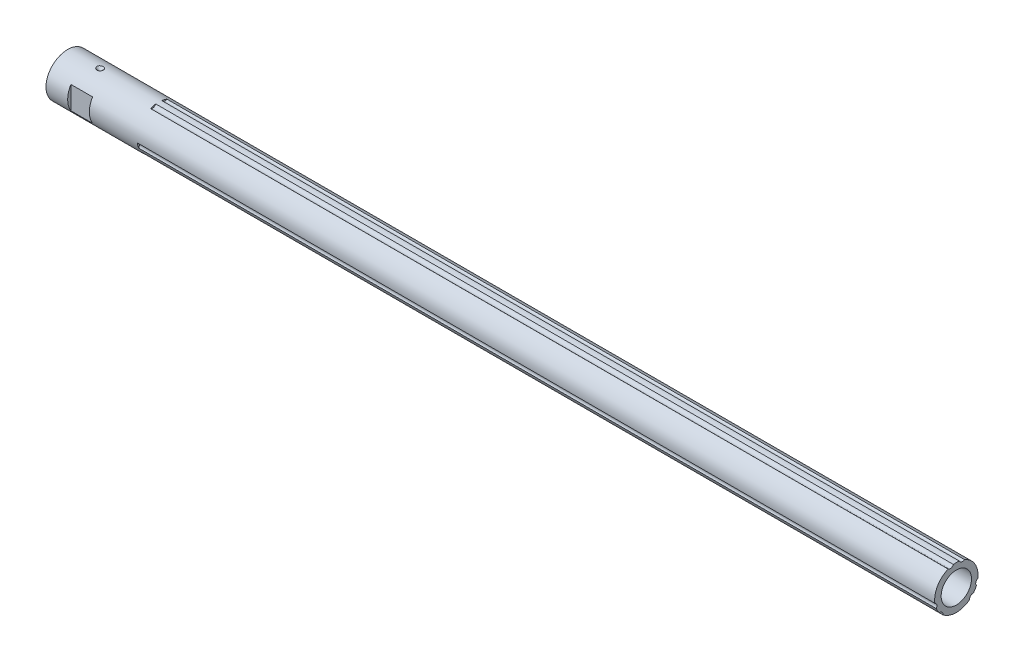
ISO-10303-21;
HEADER;
FILE_DESCRIPTION(('STEP AP214'),'2;1');
FILE_NAME('part.step','',(''),(''),'','','');
FILE_SCHEMA(('AUTOMOTIVE_DESIGN { 1 0 10303 214 1 1 1 1 }'));
ENDSEC;
DATA;
#1=APPLICATION_CONTEXT('core data for automotive mechanical design processes');
#2=APPLICATION_PROTOCOL_DEFINITION('international standard','automotive_design',2000,#1);
#3=PRODUCT_CONTEXT('',#1,'mechanical');
#4=PRODUCT('Part','Part','',(#3));
#5=PRODUCT_RELATED_PRODUCT_CATEGORY('part','',(#4));
#6=PRODUCT_DEFINITION_FORMATION('','',#4);
#7=PRODUCT_DEFINITION_CONTEXT('part definition',#1,'design');
#8=PRODUCT_DEFINITION('design','',#6,#7);
#9=PRODUCT_DEFINITION_SHAPE('','',#8);
#10=(LENGTH_UNIT() NAMED_UNIT(*) SI_UNIT(.MILLI.,.METRE.));
#11=(NAMED_UNIT(*) PLANE_ANGLE_UNIT() SI_UNIT($,.RADIAN.));
#12=(NAMED_UNIT(*) SI_UNIT($,.STERADIAN.) SOLID_ANGLE_UNIT());
#13=UNCERTAINTY_MEASURE_WITH_UNIT(LENGTH_MEASURE(1.E-05),#10,'distance_accuracy_value','');
#14=(GEOMETRIC_REPRESENTATION_CONTEXT(3) GLOBAL_UNCERTAINTY_ASSIGNED_CONTEXT((#13)) GLOBAL_UNIT_ASSIGNED_CONTEXT((#10,
#11,#12)) REPRESENTATION_CONTEXT('',''));
#15=CARTESIAN_POINT('',(0.,0.,0.));
#16=DIRECTION('',(0.,0.,1.));
#17=DIRECTION('',(1.,0.,0.));
#18=AXIS2_PLACEMENT_3D('',#15,#16,#17);
#19=CARTESIAN_POINT('',(0.,0.,0.));
#20=DIRECTION('',(1.,0.,0.));
#21=DIRECTION('',(0.,0.,-1.));
#22=AXIS2_PLACEMENT_3D('',#19,#20,#21);
#23=PLANE('',#22);
#24=CARTESIAN_POINT('',(0.,-2.82112759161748,-10.5285915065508));
#25=DIRECTION('',(1.,0.,0.));
#26=DIRECTION('',(0.,0.,-1.));
#27=AXIS2_PLACEMENT_3D('',#24,#25,#26);
#28=CIRCLE('',#27,1.588);
#29=CARTESIAN_POINT('',(0.,-1.35978777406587,-9.9071175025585));
#30=VERTEX_POINT('',#29);
#31=CARTESIAN_POINT('',(0.,-3.77594799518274,-9.25970932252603));
#32=VERTEX_POINT('',#31);
#33=EDGE_CURVE('E352',#30,#32,#28,.T.);
#34=ORIENTED_EDGE('',*,*,#33,.T.);
#35=CARTESIAN_POINT('',(0.,0.,0.));
#36=DIRECTION('',(-1.,0.,0.));
#37=DIRECTION('',(0.,0.,1.));
#38=AXIS2_PLACEMENT_3D('',#35,#36,#37);
#39=CIRCLE('',#38,10.);
#40=EDGE_CURVE('E190',#30,#32,#39,.T.);
#41=ORIENTED_EDGE('',*,*,#40,.F.);
#42=EDGE_LOOP('',(#34,#41));
#43=FACE_BOUND('',#42,.T.);
#44=ADVANCED_FACE('F17',(#43),#23,.T.);
#45=CARTESIAN_POINT('',(0.,0.,0.));
#46=DIRECTION('',(1.,0.,0.));
#47=DIRECTION('',(0.,0.,-1.));
#48=AXIS2_PLACEMENT_3D('',#45,#46,#47);
#49=PLANE('',#48);
#50=CARTESIAN_POINT('',(0.,-7.70746391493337,-7.70746391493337));
#51=DIRECTION('',(1.,0.,0.));
#52=DIRECTION('',(0.,0.,-1.));
#53=AXIS2_PLACEMENT_3D('',#50,#51,#52);
#54=CIRCLE('',#53,1.588);
#55=CARTESIAN_POINT('',(0.,-6.1311695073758,-7.89992154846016));
#56=VERTEX_POINT('',#55);
#57=CARTESIAN_POINT('',(0.,-7.89992154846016,-6.13116950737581));
#58=VERTEX_POINT('',#57);
#59=EDGE_CURVE('E20',#56,#58,#54,.T.);
#60=ORIENTED_EDGE('',*,*,#59,.T.);
#61=CARTESIAN_POINT('',(0.,0.,0.));
#62=DIRECTION('',(-1.,0.,0.));
#63=DIRECTION('',(0.,0.,1.));
#64=AXIS2_PLACEMENT_3D('',#61,#62,#63);
#65=CIRCLE('',#64,10.);
#66=EDGE_CURVE('E171',#56,#58,#65,.T.);
#67=ORIENTED_EDGE('',*,*,#66,.F.);
#68=EDGE_LOOP('',(#60,#67));
#69=FACE_BOUND('',#68,.T.);
#70=ADVANCED_FACE('F445',(#69),#49,.T.);
#71=CARTESIAN_POINT('',(0.,0.,0.));
#72=DIRECTION('',(1.,0.,0.));
#73=DIRECTION('',(0.,0.,-1.));
#74=AXIS2_PLACEMENT_3D('',#71,#72,#73);
#75=PLANE('',#74);
#76=CARTESIAN_POINT('',(0.,0.,0.));
#77=DIRECTION('',(-1.,0.,0.));
#78=DIRECTION('',(0.,0.,1.));
#79=AXIS2_PLACEMENT_3D('',#76,#77,#78);
#80=CIRCLE('',#79,10.);
#81=CARTESIAN_POINT('',(0.,-7.89992154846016,6.1311695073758));
#82=VERTEX_POINT('',#81);
#83=CARTESIAN_POINT('',(0.,-6.13116950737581,7.89992154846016));
#84=VERTEX_POINT('',#83);
#85=EDGE_CURVE('E154',#82,#84,#80,.T.);
#86=ORIENTED_EDGE('',*,*,#85,.F.);
#87=CARTESIAN_POINT('',(0.,-7.70746391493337,7.70746391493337));
#88=DIRECTION('',(1.,0.,0.));
#89=DIRECTION('',(0.,0.,-1.));
#90=AXIS2_PLACEMENT_3D('',#87,#88,#89);
#91=CIRCLE('',#90,1.588);
#92=EDGE_CURVE('E140',#82,#84,#91,.T.);
#93=ORIENTED_EDGE('',*,*,#92,.T.);
#94=EDGE_LOOP('',(#86,#93));
#95=FACE_BOUND('',#94,.T.);
#96=ADVANCED_FACE('F155',(#95),#75,.T.);
#97=CARTESIAN_POINT('',(0.,0.,0.));
#98=DIRECTION('',(1.,0.,0.));
#99=DIRECTION('',(0.,0.,-1.));
#100=AXIS2_PLACEMENT_3D('',#97,#98,#99);
#101=PLANE('',#100);
#102=CARTESIAN_POINT('',(0.,0.,0.));
#103=DIRECTION('',(-1.,0.,0.));
#104=DIRECTION('',(0.,0.,1.));
#105=AXIS2_PLACEMENT_3D('',#102,#103,#104);
#106=CIRCLE('',#105,10.);
#107=CARTESIAN_POINT('',(0.,-3.77594799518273,9.25970932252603));
#108=VERTEX_POINT('',#107);
#109=CARTESIAN_POINT('',(0.,-1.35978777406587,9.9071175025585));
#110=VERTEX_POINT('',#109);
#111=EDGE_CURVE('E180',#108,#110,#106,.T.);
#112=ORIENTED_EDGE('',*,*,#111,.F.);
#113=CARTESIAN_POINT('',(0.,-2.82112759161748,10.5285915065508));
#114=DIRECTION('',(1.,0.,0.));
#115=DIRECTION('',(0.,0.,-1.));
#116=AXIS2_PLACEMENT_3D('',#113,#114,#115);
#117=CIRCLE('',#116,1.588);
#118=EDGE_CURVE('E152',#108,#110,#117,.T.);
#119=ORIENTED_EDGE('',*,*,#118,.T.);
#120=EDGE_LOOP('',(#112,#119));
#121=FACE_BOUND('',#120,.T.);
#122=ADVANCED_FACE('F434',(#121),#101,.T.);
#123=CARTESIAN_POINT('',(189.,-7.70746391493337,-7.70746391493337));
#124=DIRECTION('',(1.,0.,0.));
#125=DIRECTION('',(0.,0.,-1.));
#126=AXIS2_PLACEMENT_3D('',#123,#124,#125);
#127=CYLINDRICAL_SURFACE('',#126,1.588);
#128=CARTESIAN_POINT('',(368.,-7.70746391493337,-7.70746391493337));
#129=DIRECTION('',(1.,0.,0.));
#130=DIRECTION('',(0.,0.,-1.));
#131=AXIS2_PLACEMENT_3D('',#128,#129,#130);
#132=CIRCLE('',#131,1.588);
#133=CARTESIAN_POINT('',(368.,-7.89992154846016,-6.13116950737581));
#134=VERTEX_POINT('',#133);
#135=CARTESIAN_POINT('',(368.,-6.1311695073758,-7.89992154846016));
#136=VERTEX_POINT('',#135);
#137=EDGE_CURVE('E367',#134,#136,#132,.F.);
#138=ORIENTED_EDGE('',*,*,#137,.F.);
#139=DIRECTION('',(-1.,0.,0.));
#140=VECTOR('',#139,1.);
#141=CARTESIAN_POINT('',(189.,-7.89992154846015,-6.13116950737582));
#142=LINE('',#141,#140);
#143=EDGE_CURVE('E166',#58,#134,#142,.F.);
#144=ORIENTED_EDGE('',*,*,#143,.F.);
#145=ORIENTED_EDGE('',*,*,#59,.F.);
#146=DIRECTION('',(-1.,0.,0.));
#147=VECTOR('',#146,1.);
#148=CARTESIAN_POINT('',(189.,-6.1311695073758,-7.89992154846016));
#149=LINE('',#148,#147);
#150=EDGE_CURVE('E195',#136,#56,#149,.T.);
#151=ORIENTED_EDGE('',*,*,#150,.F.);
#152=EDGE_LOOP('',(#138,#144,#145,#151));
#153=FACE_BOUND('',#152,.T.);
#154=ADVANCED_FACE('F436',(#153),#127,.F.);
#155=CARTESIAN_POINT('',(189.,-2.82112759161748,-10.5285915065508));
#156=DIRECTION('',(1.,0.,0.));
#157=DIRECTION('',(0.,0.,-1.));
#158=AXIS2_PLACEMENT_3D('',#155,#156,#157);
#159=CYLINDRICAL_SURFACE('',#158,1.588);
#160=CARTESIAN_POINT('',(368.,-2.82112759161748,-10.5285915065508));
#161=DIRECTION('',(1.,0.,0.));
#162=DIRECTION('',(0.,0.,-1.));
#163=AXIS2_PLACEMENT_3D('',#160,#161,#162);
#164=CIRCLE('',#163,1.588);
#165=CARTESIAN_POINT('',(368.,-3.77594799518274,-9.25970932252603));
#166=VERTEX_POINT('',#165);
#167=CARTESIAN_POINT('',(368.,-1.35978777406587,-9.9071175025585));
#168=VERTEX_POINT('',#167);
#169=EDGE_CURVE('E372',#166,#168,#164,.F.);
#170=ORIENTED_EDGE('',*,*,#169,.F.);
#171=DIRECTION('',(-1.,0.,0.));
#172=VECTOR('',#171,1.);
#173=CARTESIAN_POINT('',(189.,-3.77594799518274,-9.25970932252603));
#174=LINE('',#173,#172);
#175=EDGE_CURVE('E192',#32,#166,#174,.F.);
#176=ORIENTED_EDGE('',*,*,#175,.F.);
#177=ORIENTED_EDGE('',*,*,#33,.F.);
#178=DIRECTION('',(-1.,0.,0.));
#179=VECTOR('',#178,1.);
#180=CARTESIAN_POINT('',(189.,-1.35978777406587,-9.9071175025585));
#181=LINE('',#180,#179);
#182=EDGE_CURVE('E186',#168,#30,#181,.T.);
#183=ORIENTED_EDGE('',*,*,#182,.F.);
#184=EDGE_LOOP('',(#170,#176,#177,#183));
#185=FACE_BOUND('',#184,.T.);
#186=ADVANCED_FACE('F442',(#185),#159,.F.);
#187=CARTESIAN_POINT('',(189.,-2.82112759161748,10.5285915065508));
#188=DIRECTION('',(1.,0.,0.));
#189=DIRECTION('',(0.,0.,-1.));
#190=AXIS2_PLACEMENT_3D('',#187,#188,#189);
#191=CYLINDRICAL_SURFACE('',#190,1.588);
#192=ORIENTED_EDGE('',*,*,#118,.F.);
#193=DIRECTION('',(-1.,0.,0.));
#194=VECTOR('',#193,1.);
#195=CARTESIAN_POINT('',(189.,-3.77594799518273,9.25970932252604));
#196=LINE('',#195,#194);
#197=CARTESIAN_POINT('',(368.,-3.77594799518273,9.25970932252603));
#198=VERTEX_POINT('',#197);
#199=EDGE_CURVE('E176',#198,#108,#196,.T.);
#200=ORIENTED_EDGE('',*,*,#199,.F.);
#201=CARTESIAN_POINT('',(368.,-2.82112759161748,10.5285915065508));
#202=DIRECTION('',(1.,0.,0.));
#203=DIRECTION('',(0.,0.,-1.));
#204=AXIS2_PLACEMENT_3D('',#201,#202,#203);
#205=CIRCLE('',#204,1.588);
#206=CARTESIAN_POINT('',(368.,-1.35978777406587,9.9071175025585));
#207=VERTEX_POINT('',#206);
#208=EDGE_CURVE('E391',#207,#198,#205,.F.);
#209=ORIENTED_EDGE('',*,*,#208,.F.);
#210=DIRECTION('',(-1.,0.,0.));
#211=VECTOR('',#210,1.);
#212=CARTESIAN_POINT('',(189.,-1.35978777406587,9.9071175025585));
#213=LINE('',#212,#211);
#214=EDGE_CURVE('E181',#110,#207,#213,.F.);
#215=ORIENTED_EDGE('',*,*,#214,.F.);
#216=EDGE_LOOP('',(#192,#200,#209,#215));
#217=FACE_BOUND('',#216,.T.);
#218=ADVANCED_FACE('F414',(#217),#191,.F.);
#219=CARTESIAN_POINT('',(189.,-7.70746391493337,7.70746391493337));
#220=DIRECTION('',(1.,0.,0.));
#221=DIRECTION('',(0.,0.,-1.));
#222=AXIS2_PLACEMENT_3D('',#219,#220,#221);
#223=CYLINDRICAL_SURFACE('',#222,1.588);
#224=ORIENTED_EDGE('',*,*,#92,.F.);
#225=DIRECTION('',(-1.,0.,0.));
#226=VECTOR('',#225,1.);
#227=CARTESIAN_POINT('',(189.,-7.89992154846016,6.1311695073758));
#228=LINE('',#227,#226);
#229=CARTESIAN_POINT('',(368.,-7.89992154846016,6.1311695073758));
#230=VERTEX_POINT('',#229);
#231=EDGE_CURVE('E145',#230,#82,#228,.T.);
#232=ORIENTED_EDGE('',*,*,#231,.F.);
#233=CARTESIAN_POINT('',(368.,-7.70746391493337,7.70746391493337));
#234=DIRECTION('',(1.,0.,0.));
#235=DIRECTION('',(0.,0.,-1.));
#236=AXIS2_PLACEMENT_3D('',#233,#234,#235);
#237=CIRCLE('',#236,1.588);
#238=CARTESIAN_POINT('',(368.,-6.13116950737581,7.89992154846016));
#239=VERTEX_POINT('',#238);
#240=EDGE_CURVE('E397',#239,#230,#237,.F.);
#241=ORIENTED_EDGE('',*,*,#240,.F.);
#242=DIRECTION('',(-1.,0.,0.));
#243=VECTOR('',#242,1.);
#244=CARTESIAN_POINT('',(189.,-6.13116950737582,7.89992154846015));
#245=LINE('',#244,#243);
#246=EDGE_CURVE('E147',#84,#239,#245,.F.);
#247=ORIENTED_EDGE('',*,*,#246,.F.);
#248=EDGE_LOOP('',(#224,#232,#241,#247));
#249=FACE_BOUND('',#248,.T.);
#250=ADVANCED_FACE('F142',(#249),#223,.F.);
#251=CARTESIAN_POINT('',(189.,0.,0.));
#252=DIRECTION('',(-1.,0.,0.));
#253=DIRECTION('',(0.,0.,1.));
#254=AXIS2_PLACEMENT_3D('',#251,#252,#253);
#255=CYLINDRICAL_SURFACE('',#254,7.);
#256=CARTESIAN_POINT('',(368.,0.,0.));
#257=DIRECTION('',(-1.,0.,0.));
#258=DIRECTION('',(0.,0.,1.));
#259=AXIS2_PLACEMENT_3D('',#256,#257,#258);
#260=CIRCLE('',#259,7.);
#261=CARTESIAN_POINT('',(368.,0.,7.));
#262=VERTEX_POINT('',#261);
#263=EDGE_CURVE('E359',#262,#262,#260,.T.);
#264=ORIENTED_EDGE('',*,*,#263,.F.);
#265=EDGE_LOOP('',(#264));
#266=FACE_BOUND('',#265,.T.);
#267=CARTESIAN_POINT('',(-42.,0.,0.));
#268=DIRECTION('',(-1.,0.,0.));
#269=DIRECTION('',(0.,0.,1.));
#270=AXIS2_PLACEMENT_3D('',#267,#268,#269);
#271=CIRCLE('',#270,7.);
#272=CARTESIAN_POINT('',(-42.,0.,7.));
#273=VERTEX_POINT('',#272);
#274=EDGE_CURVE('E330',#273,#273,#271,.T.);
#275=ORIENTED_EDGE('',*,*,#274,.T.);
#276=EDGE_LOOP('',(#275));
#277=FACE_BOUND('',#276,.T.);
#278=ADVANCED_FACE('F314',(#266,#277),#255,.F.);
#279=CARTESIAN_POINT('',(-27.,10.0089999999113,0.));
#280=DIRECTION('',(0.,1.,0.));
#281=DIRECTION('',(0.,0.,1.));
#282=AXIS2_PLACEMENT_3D('',#279,#280,#281);
#283=CONICAL_SURFACE('',#282,1.50899999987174,0.785398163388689);
#284=CARTESIAN_POINT('',(-26.9999999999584,8.5000000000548,0.));
#285=VERTEX_POINT('',#284);
#286=VERTEX_LOOP('',#285);
#287=FACE_BOUND('',#286,.T.);
#288=CARTESIAN_POINT('',(-25.5000000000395,10.,7.51235718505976E-13));
#289=CARTESIAN_POINT('',(-25.500008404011,9.99999793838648,0.0745725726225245));
#290=CARTESIAN_POINT('',(-25.5064280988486,9.99915610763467,0.149214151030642));
#291=CARTESIAN_POINT('',(-25.5318721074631,9.99587903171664,0.296397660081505));
#292=CARTESIAN_POINT('',(-25.5509231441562,9.99344040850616,0.368934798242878));
#293=CARTESIAN_POINT('',(-25.6003665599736,9.98730760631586,0.508396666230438));
#294=CARTESIAN_POINT('',(-25.6305347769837,9.98363836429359,0.575402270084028));
#295=CARTESIAN_POINT('',(-25.701126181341,9.9754199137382,0.7036570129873));
#296=CARTESIAN_POINT('',(-25.7415460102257,9.97087099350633,0.76490802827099));
#297=CARTESIAN_POINT('',(-25.8335736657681,9.96110259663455,0.883253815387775));
#298=CARTESIAN_POINT('',(-25.8856364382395,9.95586106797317,0.939992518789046));
#299=CARTESIAN_POINT('',(-25.9980251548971,9.94543026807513,1.04459891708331));
#300=CARTESIAN_POINT('',(-26.0583543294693,9.9402410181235,1.09246312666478));
#301=CARTESIAN_POINT('',(-26.1899862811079,9.93007764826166,1.18139826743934));
#302=CARTESIAN_POINT('',(-26.2617573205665,9.92514249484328,1.22178098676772));
#303=CARTESIAN_POINT('',(-26.4108459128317,9.91641785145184,1.29068454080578));
#304=CARTESIAN_POINT('',(-26.4881648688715,9.91262865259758,1.31920236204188));
#305=CARTESIAN_POINT('',(-26.6506218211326,9.90641882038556,1.36507769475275));
#306=CARTESIAN_POINT('',(-26.7359566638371,9.9040828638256,1.38175159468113));
#307=CARTESIAN_POINT('',(-26.9082345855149,9.90137156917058,1.40104820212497));
#308=CARTESIAN_POINT('',(-26.9951779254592,9.90099655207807,1.40366860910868));
#309=CARTESIAN_POINT('',(-27.1704578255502,9.90226472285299,1.39469572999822));
#310=CARTESIAN_POINT('',(-27.2587764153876,9.90395752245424,1.38275305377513));
#311=CARTESIAN_POINT('',(-27.4321353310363,9.90925066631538,1.34429320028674));
#312=CARTESIAN_POINT('',(-27.5171753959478,9.912851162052,1.31777486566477));
#313=CARTESIAN_POINT('',(-27.6811820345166,9.92152267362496,1.25080734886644));
#314=CARTESIAN_POINT('',(-27.7601680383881,9.92658871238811,1.21040523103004));
#315=CARTESIAN_POINT('',(-27.9098724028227,9.93758822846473,1.11649710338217));
#316=CARTESIAN_POINT('',(-27.9805922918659,9.94352154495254,1.06299352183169));
#317=CARTESIAN_POINT('',(-28.1090039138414,9.95530313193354,0.946180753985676));
#318=CARTESIAN_POINT('',(-28.167061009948,9.96114727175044,0.883273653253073));
#319=CARTESIAN_POINT('',(-28.2709266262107,9.97222020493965,0.747940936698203));
#320=CARTESIAN_POINT('',(-28.3167348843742,9.9774489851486,0.675515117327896));
#321=CARTESIAN_POINT('',(-28.3915369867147,9.98629235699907,0.528252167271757));
#322=CARTESIAN_POINT('',(-28.4214279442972,9.98998958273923,0.453875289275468));
#323=CARTESIAN_POINT('',(-28.4673080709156,9.99575801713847,0.301037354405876));
#324=CARTESIAN_POINT('',(-28.4833349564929,9.99783363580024,0.222587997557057));
#325=CARTESIAN_POINT('',(-28.4973645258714,9.99965603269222,0.0957909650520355));
#326=CARTESIAN_POINT('',(-28.5000053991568,10.0000013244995,0.0479097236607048));
#327=CARTESIAN_POINT('',(-28.4999915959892,9.99999793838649,-0.0745725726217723));
#328=CARTESIAN_POINT('',(-28.4935719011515,9.99915610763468,-0.149214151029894));
#329=CARTESIAN_POINT('',(-28.4681278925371,9.99587903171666,-0.296397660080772));
#330=CARTESIAN_POINT('',(-28.4490768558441,9.99344040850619,-0.368934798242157));
#331=CARTESIAN_POINT('',(-28.3996334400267,9.98730760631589,-0.508396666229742));
#332=CARTESIAN_POINT('',(-28.3694652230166,9.98363836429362,-0.575402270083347));
#333=CARTESIAN_POINT('',(-28.2988738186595,9.97541991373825,-0.703657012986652));
#334=CARTESIAN_POINT('',(-28.2584539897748,9.97087099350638,-0.764908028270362));
#335=CARTESIAN_POINT('',(-28.1664263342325,9.96110259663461,-0.883253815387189));
#336=CARTESIAN_POINT('',(-28.1143635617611,9.95586106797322,-0.939992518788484));
#337=CARTESIAN_POINT('',(-28.0019748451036,9.94543026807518,-1.0445989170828));
#338=CARTESIAN_POINT('',(-27.9416456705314,9.94024101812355,-1.09246312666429));
#339=CARTESIAN_POINT('',(-27.8100137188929,9.93007764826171,-1.18139826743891));
#340=CARTESIAN_POINT('',(-27.7382426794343,9.92514249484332,-1.22178098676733));
#341=CARTESIAN_POINT('',(-27.5891540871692,9.91641785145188,-1.29068454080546));
#342=CARTESIAN_POINT('',(-27.5118351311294,9.91262865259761,-1.3192023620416));
#343=CARTESIAN_POINT('',(-27.3493781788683,9.90641882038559,-1.36507769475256));
#344=CARTESIAN_POINT('',(-27.2640433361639,9.90408286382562,-1.38175159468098));
#345=CARTESIAN_POINT('',(-27.091765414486,9.90137156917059,-1.40104820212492));
#346=CARTESIAN_POINT('',(-27.0048220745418,9.90099655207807,-1.40366860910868));
#347=CARTESIAN_POINT('',(-26.8295421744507,9.90226472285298,-1.39469572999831));
#348=CARTESIAN_POINT('',(-26.7412235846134,9.90395752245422,-1.38275305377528));
#349=CARTESIAN_POINT('',(-26.5678646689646,9.90925066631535,-1.34429320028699));
#350=CARTESIAN_POINT('',(-26.4828246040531,9.91285116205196,-1.31777486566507));
#351=CARTESIAN_POINT('',(-26.3188179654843,9.92152267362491,-1.25080734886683));
#352=CARTESIAN_POINT('',(-26.2398319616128,9.92658871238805,-1.21040523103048));
#353=CARTESIAN_POINT('',(-26.0901275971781,9.93758822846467,-1.1164971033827));
#354=CARTESIAN_POINT('',(-26.0194077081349,9.94352154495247,-1.06299352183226));
#355=CARTESIAN_POINT('',(-25.8909960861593,9.95530313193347,-0.946180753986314));
#356=CARTESIAN_POINT('',(-25.8329389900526,9.96114727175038,-0.883273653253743));
#357=CARTESIAN_POINT('',(-25.7290733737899,9.9722202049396,-0.747940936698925));
#358=CARTESIAN_POINT('',(-25.6832651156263,9.97744898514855,-0.675515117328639));
#359=CARTESIAN_POINT('',(-25.6084630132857,9.98629235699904,-0.528252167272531));
#360=CARTESIAN_POINT('',(-25.5785720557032,9.9899895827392,-0.453875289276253));
#361=CARTESIAN_POINT('',(-25.5326919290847,9.99575801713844,-0.301037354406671));
#362=CARTESIAN_POINT('',(-25.5166650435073,9.99783363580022,-0.222587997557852));
#363=CARTESIAN_POINT('',(-25.5026354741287,9.99965603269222,-0.0957909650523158));
#364=CARTESIAN_POINT('',(-25.4999946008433,10.0000013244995,-0.0479097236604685));
#365=CARTESIAN_POINT('',(-25.5000000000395,10.,7.51235718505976E-13));
#366=B_SPLINE_CURVE_WITH_KNOTS('',3,(#288,#289,#290,#291,#292,#293,#294,#295,#296,#297,#298,
#299,#300,#301,#302,#303,#304,#305,#306,#307,#308,#309,#310,#311,#312,#313,#314,#315,#316,#317,
#318,#319,#320,#321,#322,#323,#324,#325,#326,#327,#328,#329,#330,#331,#332,#333,#334,#335,#336,
#337,#338,#339,#340,#341,#342,#343,#344,#345,#346,#347,#348,#349,#350,#351,#352,#353,#354,#355,
#356,#357,#358,#359,#360,#361,#362,#363,#364,#365),.UNSPECIFIED.,.T.,.F.,(4,2,2,2,2,2,2,2,2,2,2,
2,2,2,2,2,2,2,2,2,2,2,2,2,2,2,2,2,2,2,2,2,2,2,2,2,2,2,4),(0.,0.223562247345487,
0.447598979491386,0.66734561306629,0.887020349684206,1.11757444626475,1.348218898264,
1.59463279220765,1.84110923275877,2.10085725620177,2.36064779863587,2.62679563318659,
2.89296460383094,3.15824005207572,3.42346637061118,3.67954022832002,3.93561956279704,
4.17510754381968,4.4139419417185,4.55757122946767,4.78113347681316,5.00517020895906,
5.22491684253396,5.44459157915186,5.67514567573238,5.9057901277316,6.15220402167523,
6.39868046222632,6.6584284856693,6.91821902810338,7.18436686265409,7.45053583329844,
7.71581128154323,7.9810376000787,8.23711145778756,8.4931907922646,8.73267877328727,
8.97151317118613,9.11514245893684),.UNSPECIFIED.);
#367=CARTESIAN_POINT('',(-25.5000000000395,10.,7.51235718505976E-13));
#368=VERTEX_POINT('',#367);
#369=EDGE_CURVE('E247',#368,#368,#366,.T.);
#370=ORIENTED_EDGE('',*,*,#369,.F.);
#371=EDGE_LOOP('',(#370));
#372=FACE_BOUND('',#371,.T.);
#373=ADVANCED_FACE('F257',(#287,#372),#283,.F.);
#374=CARTESIAN_POINT('',(-22.,-6.,-10.));
#375=DIRECTION('',(1.,0.,0.));
#376=DIRECTION('',(0.,0.,-1.));
#377=AXIS2_PLACEMENT_3D('',#374,#375,#376);
#378=PLANE('',#377);
#379=CARTESIAN_POINT('',(-22.,0.,0.));
#380=DIRECTION('',(-1.,0.,0.));
#381=DIRECTION('',(0.,0.,1.));
#382=AXIS2_PLACEMENT_3D('',#379,#380,#381);
#383=CIRCLE('',#382,10.);
#384=CARTESIAN_POINT('',(-22.,-5.26782687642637,-8.5));
#385=VERTEX_POINT('',#384);
#386=CARTESIAN_POINT('',(-22.,5.26782687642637,-8.5));
#387=VERTEX_POINT('',#386);
#388=EDGE_CURVE('E240',#385,#387,#383,.F.);
#389=ORIENTED_EDGE('',*,*,#388,.F.);
#390=DIRECTION('',(0.,1.,0.));
#391=VECTOR('',#390,1.);
#392=CARTESIAN_POINT('',(-22.,-6.,-8.5));
#393=LINE('',#392,#391);
#394=EDGE_CURVE('E151',#385,#387,#393,.T.);
#395=ORIENTED_EDGE('',*,*,#394,.T.);
#396=EDGE_LOOP('',(#389,#395));
#397=FACE_BOUND('',#396,.T.);
#398=ADVANCED_FACE('F306',(#397),#378,.F.);
#399=CARTESIAN_POINT('',(-32.,-6.,-8.5));
#400=DIRECTION('',(0.,0.,1.));
#401=DIRECTION('',(1.,0.,0.));
#402=AXIS2_PLACEMENT_3D('',#399,#400,#401);
#403=PLANE('',#402);
#404=ORIENTED_EDGE('',*,*,#394,.F.);
#405=DIRECTION('',(-1.,0.,0.));
#406=VECTOR('',#405,1.);
#407=CARTESIAN_POINT('',(189.,-5.26782687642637,-8.5));
#408=LINE('',#407,#406);
#409=CARTESIAN_POINT('',(-32.,-5.26782687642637,-8.5));
#410=VERTEX_POINT('',#409);
#411=EDGE_CURVE('E199',#410,#385,#408,.F.);
#412=ORIENTED_EDGE('',*,*,#411,.F.);
#413=DIRECTION('',(0.,1.,0.));
#414=VECTOR('',#413,1.);
#415=CARTESIAN_POINT('',(-32.,-6.,-8.5));
#416=LINE('',#415,#414);
#417=CARTESIAN_POINT('',(-32.,5.26782687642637,-8.5));
#418=VERTEX_POINT('',#417);
#419=EDGE_CURVE('E324',#410,#418,#416,.T.);
#420=ORIENTED_EDGE('',*,*,#419,.T.);
#421=DIRECTION('',(-1.,0.,0.));
#422=VECTOR('',#421,1.);
#423=CARTESIAN_POINT('',(189.,5.26782687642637,-8.5));
#424=LINE('',#423,#422);
#425=EDGE_CURVE('E239',#387,#418,#424,.T.);
#426=ORIENTED_EDGE('',*,*,#425,.F.);
#427=EDGE_LOOP('',(#404,#412,#420,#426));
#428=FACE_BOUND('',#427,.T.);
#429=ADVANCED_FACE('F303',(#428),#403,.F.);
#430=CARTESIAN_POINT('',(-32.,-6.,-10.));
#431=DIRECTION('',(-1.,0.,0.));
#432=DIRECTION('',(0.,0.,1.));
#433=AXIS2_PLACEMENT_3D('',#430,#431,#432);
#434=PLANE('',#433);
#435=ORIENTED_EDGE('',*,*,#419,.F.);
#436=CARTESIAN_POINT('',(-32.,0.,0.));
#437=DIRECTION('',(-1.,0.,0.));
#438=DIRECTION('',(0.,0.,1.));
#439=AXIS2_PLACEMENT_3D('',#436,#437,#438);
#440=CIRCLE('',#439,10.);
#441=EDGE_CURVE('E236',#418,#410,#440,.T.);
#442=ORIENTED_EDGE('',*,*,#441,.F.);
#443=EDGE_LOOP('',(#435,#442));
#444=FACE_BOUND('',#443,.T.);
#445=ADVANCED_FACE('F299',(#444),#434,.F.);
#446=CARTESIAN_POINT('',(-42.,0.,0.));
#447=DIRECTION('',(1.,0.,0.));
#448=DIRECTION('',(0.,0.,-1.));
#449=AXIS2_PLACEMENT_3D('',#446,#447,#448);
#450=PLANE('',#449);
#451=CARTESIAN_POINT('',(-42.,0.,0.));
#452=DIRECTION('',(-1.,0.,0.));
#453=DIRECTION('',(0.,0.,1.));
#454=AXIS2_PLACEMENT_3D('',#451,#452,#453);
#455=CIRCLE('',#454,10.);
#456=CARTESIAN_POINT('',(-42.,0.,10.));
#457=VERTEX_POINT('',#456);
#458=EDGE_CURVE('E232',#457,#457,#455,.F.);
#459=ORIENTED_EDGE('',*,*,#458,.F.);
#460=EDGE_LOOP('',(#459));
#461=FACE_BOUND('',#460,.T.);
#462=ORIENTED_EDGE('',*,*,#274,.F.);
#463=EDGE_LOOP('',(#462));
#464=FACE_BOUND('',#463,.T.);
#465=ADVANCED_FACE('F295',(#461,#464),#450,.F.);
#466=CARTESIAN_POINT('',(-32.,-6.,10.));
#467=DIRECTION('',(-1.,0.,0.));
#468=DIRECTION('',(0.,0.,1.));
#469=AXIS2_PLACEMENT_3D('',#466,#467,#468);
#470=PLANE('',#469);
#471=CARTESIAN_POINT('',(-32.,0.,0.));
#472=DIRECTION('',(-1.,0.,0.));
#473=DIRECTION('',(0.,0.,1.));
#474=AXIS2_PLACEMENT_3D('',#471,#472,#473);
#475=CIRCLE('',#474,10.);
#476=CARTESIAN_POINT('',(-32.,-5.26782687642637,8.5));
#477=VERTEX_POINT('',#476);
#478=CARTESIAN_POINT('',(-32.,5.26782687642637,8.5));
#479=VERTEX_POINT('',#478);
#480=EDGE_CURVE('E228',#477,#479,#475,.T.);
#481=ORIENTED_EDGE('',*,*,#480,.F.);
#482=DIRECTION('',(0.,1.,0.));
#483=VECTOR('',#482,1.);
#484=CARTESIAN_POINT('',(-32.,-6.,8.5));
#485=LINE('',#484,#483);
#486=EDGE_CURVE('E334',#477,#479,#485,.T.);
#487=ORIENTED_EDGE('',*,*,#486,.T.);
#488=EDGE_LOOP('',(#481,#487));
#489=FACE_BOUND('',#488,.T.);
#490=ADVANCED_FACE('F291',(#489),#470,.F.);
#491=CARTESIAN_POINT('',(-32.,-6.,8.5));
#492=DIRECTION('',(0.,0.,-1.));
#493=DIRECTION('',(-1.,0.,0.));
#494=AXIS2_PLACEMENT_3D('',#491,#492,#493);
#495=PLANE('',#494);
#496=DIRECTION('',(0.,1.,0.));
#497=VECTOR('',#496,1.);
#498=CARTESIAN_POINT('',(-22.,-6.,8.5));
#499=LINE('',#498,#497);
#500=CARTESIAN_POINT('',(-22.,-5.26782687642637,8.5));
#501=VERTEX_POINT('',#500);
#502=CARTESIAN_POINT('',(-22.,5.26782687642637,8.5));
#503=VERTEX_POINT('',#502);
#504=EDGE_CURVE('E191',#501,#503,#499,.T.);
#505=ORIENTED_EDGE('',*,*,#504,.T.);
#506=DIRECTION('',(-1.,0.,0.));
#507=VECTOR('',#506,1.);
#508=CARTESIAN_POINT('',(189.,5.26782687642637,8.5));
#509=LINE('',#508,#507);
#510=EDGE_CURVE('E227',#479,#503,#509,.F.);
#511=ORIENTED_EDGE('',*,*,#510,.F.);
#512=ORIENTED_EDGE('',*,*,#486,.F.);
#513=DIRECTION('',(-1.,0.,0.));
#514=VECTOR('',#513,1.);
#515=CARTESIAN_POINT('',(189.,-5.26782687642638,8.5));
#516=LINE('',#515,#514);
#517=EDGE_CURVE('E185',#501,#477,#516,.T.);
#518=ORIENTED_EDGE('',*,*,#517,.F.);
#519=EDGE_LOOP('',(#505,#511,#512,#518));
#520=FACE_BOUND('',#519,.T.);
#521=ADVANCED_FACE('F287',(#520),#495,.F.);
#522=CARTESIAN_POINT('',(-22.,-6.,10.));
#523=DIRECTION('',(1.,0.,0.));
#524=DIRECTION('',(0.,0.,-1.));
#525=AXIS2_PLACEMENT_3D('',#522,#523,#524);
#526=PLANE('',#525);
#527=ORIENTED_EDGE('',*,*,#504,.F.);
#528=CARTESIAN_POINT('',(-22.,0.,0.));
#529=DIRECTION('',(-1.,0.,0.));
#530=DIRECTION('',(0.,0.,1.));
#531=AXIS2_PLACEMENT_3D('',#528,#529,#530);
#532=CIRCLE('',#531,10.);
#533=EDGE_CURVE('E224',#503,#501,#532,.F.);
#534=ORIENTED_EDGE('',*,*,#533,.F.);
#535=EDGE_LOOP('',(#527,#534));
#536=FACE_BOUND('',#535,.T.);
#537=ADVANCED_FACE('F283',(#536),#526,.F.);
#538=CARTESIAN_POINT('',(0.,0.,0.));
#539=DIRECTION('',(1.,0.,0.));
#540=DIRECTION('',(0.,0.,-1.));
#541=AXIS2_PLACEMENT_3D('',#538,#539,#540);
#542=PLANE('',#541);
#543=CARTESIAN_POINT('',(0.,10.5285915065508,2.82112759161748));
#544=DIRECTION('',(1.,0.,0.));
#545=DIRECTION('',(0.,0.,-1.));
#546=AXIS2_PLACEMENT_3D('',#543,#544,#545);
#547=CIRCLE('',#546,1.588);
#548=CARTESIAN_POINT('',(0.,9.25970932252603,3.77594799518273));
#549=VERTEX_POINT('',#548);
#550=CARTESIAN_POINT('',(0.,9.9071175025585,1.35978777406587));
#551=VERTEX_POINT('',#550);
#552=EDGE_CURVE('E203',#549,#551,#547,.T.);
#553=ORIENTED_EDGE('',*,*,#552,.T.);
#554=CARTESIAN_POINT('',(0.,0.,0.));
#555=DIRECTION('',(-1.,0.,0.));
#556=DIRECTION('',(0.,0.,1.));
#557=AXIS2_PLACEMENT_3D('',#554,#555,#556);
#558=CIRCLE('',#557,10.);
#559=EDGE_CURVE('E215',#549,#551,#558,.T.);
#560=ORIENTED_EDGE('',*,*,#559,.F.);
#561=EDGE_LOOP('',(#553,#560));
#562=FACE_BOUND('',#561,.T.);
#563=ADVANCED_FACE('F279',(#562),#542,.T.);
#564=CARTESIAN_POINT('',(189.,10.5285915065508,2.82112759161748));
#565=DIRECTION('',(1.,0.,0.));
#566=DIRECTION('',(0.,0.,-1.));
#567=AXIS2_PLACEMENT_3D('',#564,#565,#566);
#568=CYLINDRICAL_SURFACE('',#567,1.588);
#569=CARTESIAN_POINT('',(368.,10.5285915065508,2.82112759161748));
#570=DIRECTION('',(1.,0.,0.));
#571=DIRECTION('',(0.,0.,-1.));
#572=AXIS2_PLACEMENT_3D('',#569,#570,#571);
#573=CIRCLE('',#572,1.588);
#574=CARTESIAN_POINT('',(368.,9.9071175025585,1.35978777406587));
#575=VERTEX_POINT('',#574);
#576=CARTESIAN_POINT('',(368.,9.25970932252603,3.77594799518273));
#577=VERTEX_POINT('',#576);
#578=EDGE_CURVE('E375',#575,#577,#573,.F.);
#579=ORIENTED_EDGE('',*,*,#578,.F.);
#580=DIRECTION('',(-1.,0.,0.));
#581=VECTOR('',#580,1.);
#582=CARTESIAN_POINT('',(189.,9.9071175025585,1.35978777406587));
#583=LINE('',#582,#581);
#584=EDGE_CURVE('E214',#551,#575,#583,.F.);
#585=ORIENTED_EDGE('',*,*,#584,.F.);
#586=ORIENTED_EDGE('',*,*,#552,.F.);
#587=DIRECTION('',(-1.,0.,0.));
#588=VECTOR('',#587,1.);
#589=CARTESIAN_POINT('',(189.,9.25970932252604,3.77594799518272));
#590=LINE('',#589,#588);
#591=EDGE_CURVE('E219',#577,#549,#590,.T.);
#592=ORIENTED_EDGE('',*,*,#591,.F.);
#593=EDGE_LOOP('',(#579,#585,#586,#592));
#594=FACE_BOUND('',#593,.T.);
#595=ADVANCED_FACE('F275',(#594),#568,.F.);
#596=CARTESIAN_POINT('',(368.,-3.85373195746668,-3.85373195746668));
#597=DIRECTION('',(1.,0.,0.));
#598=DIRECTION('',(0.,0.,-1.));
#599=AXIS2_PLACEMENT_3D('',#596,#597,#598);
#600=PLANE('',#599);
#601=ORIENTED_EDGE('',*,*,#263,.T.);
#602=EDGE_LOOP('',(#601));
#603=FACE_BOUND('',#602,.T.);
#604=ORIENTED_EDGE('',*,*,#240,.T.);
#605=CARTESIAN_POINT('',(368.,0.,0.));
#606=DIRECTION('',(-1.,0.,0.));
#607=DIRECTION('',(0.,0.,1.));
#608=AXIS2_PLACEMENT_3D('',#605,#606,#607);
#609=CIRCLE('',#608,10.);
#610=EDGE_CURVE('E164',#230,#134,#609,.F.);
#611=ORIENTED_EDGE('',*,*,#610,.T.);
#612=ORIENTED_EDGE('',*,*,#137,.T.);
#613=CARTESIAN_POINT('',(368.,0.,0.));
#614=DIRECTION('',(-1.,0.,0.));
#615=DIRECTION('',(0.,0.,1.));
#616=AXIS2_PLACEMENT_3D('',#613,#614,#615);
#617=CIRCLE('',#616,10.);
#618=EDGE_CURVE('E369',#136,#166,#617,.F.);
#619=ORIENTED_EDGE('',*,*,#618,.T.);
#620=ORIENTED_EDGE('',*,*,#169,.T.);
#621=CARTESIAN_POINT('',(368.,0.,0.));
#622=DIRECTION('',(-1.,0.,0.));
#623=DIRECTION('',(0.,0.,1.));
#624=AXIS2_PLACEMENT_3D('',#621,#622,#623);
#625=CIRCLE('',#624,10.);
#626=CARTESIAN_POINT('',(368.,9.25970932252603,-3.77594799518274));
#627=VERTEX_POINT('',#626);
#628=EDGE_CURVE('E244',#627,#168,#625,.T.);
#629=ORIENTED_EDGE('',*,*,#628,.F.);
#630=CARTESIAN_POINT('',(368.,10.5285915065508,-2.82112759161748));
#631=DIRECTION('',(1.,0.,0.));
#632=DIRECTION('',(0.,0.,-1.));
#633=AXIS2_PLACEMENT_3D('',#630,#631,#632);
#634=CIRCLE('',#633,1.588);
#635=CARTESIAN_POINT('',(368.,9.9071175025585,-1.35978777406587));
#636=VERTEX_POINT('',#635);
#637=EDGE_CURVE('E255',#627,#636,#634,.F.);
#638=ORIENTED_EDGE('',*,*,#637,.T.);
#639=CARTESIAN_POINT('',(368.,0.,0.));
#640=DIRECTION('',(-1.,0.,0.));
#641=DIRECTION('',(0.,0.,1.));
#642=AXIS2_PLACEMENT_3D('',#639,#640,#641);
#643=CIRCLE('',#642,10.);
#644=EDGE_CURVE('E210',#575,#636,#643,.T.);
#645=ORIENTED_EDGE('',*,*,#644,.F.);
#646=ORIENTED_EDGE('',*,*,#578,.T.);
#647=CARTESIAN_POINT('',(368.,0.,0.));
#648=DIRECTION('',(-1.,0.,0.));
#649=DIRECTION('',(0.,0.,1.));
#650=AXIS2_PLACEMENT_3D('',#647,#648,#649);
#651=CIRCLE('',#650,10.);
#652=EDGE_CURVE('E220',#207,#577,#651,.T.);
#653=ORIENTED_EDGE('',*,*,#652,.F.);
#654=ORIENTED_EDGE('',*,*,#208,.T.);
#655=CARTESIAN_POINT('',(368.,0.,0.));
#656=DIRECTION('',(-1.,0.,0.));
#657=DIRECTION('',(0.,0.,1.));
#658=AXIS2_PLACEMENT_3D('',#655,#656,#657);
#659=CIRCLE('',#658,10.);
#660=EDGE_CURVE('E403',#198,#239,#659,.F.);
#661=ORIENTED_EDGE('',*,*,#660,.T.);
#662=EDGE_LOOP('',(#604,#611,#612,#619,#620,#629,#638,#645,#646,#653,#654,#661));
#663=FACE_BOUND('',#662,.T.);
#664=ADVANCED_FACE('F272',(#603,#663),#600,.T.);
#665=CARTESIAN_POINT('',(0.,0.,0.));
#666=DIRECTION('',(1.,0.,0.));
#667=DIRECTION('',(0.,0.,-1.));
#668=AXIS2_PLACEMENT_3D('',#665,#666,#667);
#669=PLANE('',#668);
#670=CARTESIAN_POINT('',(0.,10.5285915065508,-2.82112759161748));
#671=DIRECTION('',(1.,0.,0.));
#672=DIRECTION('',(0.,0.,-1.));
#673=AXIS2_PLACEMENT_3D('',#670,#671,#672);
#674=CIRCLE('',#673,1.588);
#675=CARTESIAN_POINT('',(0.,9.9071175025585,-1.35978777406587));
#676=VERTEX_POINT('',#675);
#677=CARTESIAN_POINT('',(0.,9.25970932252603,-3.77594799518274));
#678=VERTEX_POINT('',#677);
#679=EDGE_CURVE('E39',#676,#678,#674,.T.);
#680=ORIENTED_EDGE('',*,*,#679,.T.);
#681=CARTESIAN_POINT('',(0.,0.,0.));
#682=DIRECTION('',(-1.,0.,0.));
#683=DIRECTION('',(0.,0.,1.));
#684=AXIS2_PLACEMENT_3D('',#681,#682,#683);
#685=CIRCLE('',#684,10.);
#686=EDGE_CURVE('E27',#676,#678,#685,.T.);
#687=ORIENTED_EDGE('',*,*,#686,.F.);
#688=EDGE_LOOP('',(#680,#687));
#689=FACE_BOUND('',#688,.T.);
#690=ADVANCED_FACE('F268',(#689),#669,.T.);
#691=CARTESIAN_POINT('',(189.,10.5285915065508,-2.82112759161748));
#692=DIRECTION('',(1.,0.,0.));
#693=DIRECTION('',(0.,0.,-1.));
#694=AXIS2_PLACEMENT_3D('',#691,#692,#693);
#695=CYLINDRICAL_SURFACE('',#694,1.588);
#696=ORIENTED_EDGE('',*,*,#637,.F.);
#697=DIRECTION('',(-1.,0.,0.));
#698=VECTOR('',#697,1.);
#699=CARTESIAN_POINT('',(189.,9.25970932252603,-3.77594799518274));
#700=LINE('',#699,#698);
#701=EDGE_CURVE('E11',#678,#627,#700,.F.);
#702=ORIENTED_EDGE('',*,*,#701,.F.);
#703=ORIENTED_EDGE('',*,*,#679,.F.);
#704=DIRECTION('',(-1.,0.,0.));
#705=VECTOR('',#704,1.);
#706=CARTESIAN_POINT('',(189.,9.9071175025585,-1.35978777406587));
#707=LINE('',#706,#705);
#708=EDGE_CURVE('E209',#636,#676,#707,.T.);
#709=ORIENTED_EDGE('',*,*,#708,.F.);
#710=EDGE_LOOP('',(#696,#702,#703,#709));
#711=FACE_BOUND('',#710,.T.);
#712=ADVANCED_FACE('F264',(#711),#695,.F.);
#713=CARTESIAN_POINT('',(189.,0.,0.));
#714=DIRECTION('',(-1.,0.,0.));
#715=DIRECTION('',(0.,0.,1.));
#716=AXIS2_PLACEMENT_3D('',#713,#714,#715);
#717=CYLINDRICAL_SURFACE('',#716,10.);
#718=ORIENTED_EDGE('',*,*,#411,.T.);
#719=ORIENTED_EDGE('',*,*,#388,.T.);
#720=ORIENTED_EDGE('',*,*,#425,.T.);
#721=ORIENTED_EDGE('',*,*,#441,.T.);
#722=EDGE_LOOP('',(#718,#719,#720,#721));
#723=FACE_BOUND('',#722,.T.);
#724=ORIENTED_EDGE('',*,*,#458,.T.);
#725=EDGE_LOOP('',(#724));
#726=FACE_BOUND('',#725,.T.);
#727=ORIENTED_EDGE('',*,*,#517,.T.);
#728=ORIENTED_EDGE('',*,*,#480,.T.);
#729=ORIENTED_EDGE('',*,*,#510,.T.);
#730=ORIENTED_EDGE('',*,*,#533,.T.);
#731=EDGE_LOOP('',(#727,#728,#729,#730));
#732=FACE_BOUND('',#731,.T.);
#733=ORIENTED_EDGE('',*,*,#686,.T.);
#734=ORIENTED_EDGE('',*,*,#701,.T.);
#735=ORIENTED_EDGE('',*,*,#628,.T.);
#736=ORIENTED_EDGE('',*,*,#182,.T.);
#737=ORIENTED_EDGE('',*,*,#40,.T.);
#738=ORIENTED_EDGE('',*,*,#175,.T.);
#739=ORIENTED_EDGE('',*,*,#618,.F.);
#740=ORIENTED_EDGE('',*,*,#150,.T.);
#741=ORIENTED_EDGE('',*,*,#66,.T.);
#742=ORIENTED_EDGE('',*,*,#143,.T.);
#743=ORIENTED_EDGE('',*,*,#610,.F.);
#744=ORIENTED_EDGE('',*,*,#231,.T.);
#745=ORIENTED_EDGE('',*,*,#85,.T.);
#746=ORIENTED_EDGE('',*,*,#246,.T.);
#747=ORIENTED_EDGE('',*,*,#660,.F.);
#748=ORIENTED_EDGE('',*,*,#199,.T.);
#749=ORIENTED_EDGE('',*,*,#111,.T.);
#750=ORIENTED_EDGE('',*,*,#214,.T.);
#751=ORIENTED_EDGE('',*,*,#652,.T.);
#752=ORIENTED_EDGE('',*,*,#591,.T.);
#753=ORIENTED_EDGE('',*,*,#559,.T.);
#754=ORIENTED_EDGE('',*,*,#584,.T.);
#755=ORIENTED_EDGE('',*,*,#644,.T.);
#756=ORIENTED_EDGE('',*,*,#708,.T.);
#757=EDGE_LOOP('',(#733,#734,#735,#736,#737,#738,#739,#740,#741,#742,#743,#744,#745,#746,#747,
#748,#749,#750,#751,#752,#753,#754,#755,#756));
#758=FACE_BOUND('',#757,.T.);
#759=ORIENTED_EDGE('',*,*,#369,.T.);
#760=EDGE_LOOP('',(#759));
#761=FACE_BOUND('',#760,.T.);
#762=ADVANCED_FACE('F160',(#723,#726,#732,#758,#761),#717,.T.);
#763=CLOSED_SHELL('',(#44,#70,#96,#122,#154,#186,#218,#250,#278,#373,#398,#429,#445,#465,#490,
#521,#537,#563,#595,#664,#690,#712,#762));
#764=MANIFOLD_SOLID_BREP('B1',#763);
#765=ADVANCED_BREP_SHAPE_REPRESENTATION('',(#18,#764),#14);
#766=SHAPE_DEFINITION_REPRESENTATION(#9,#765);
ENDSEC;
END-ISO-10303-21;
